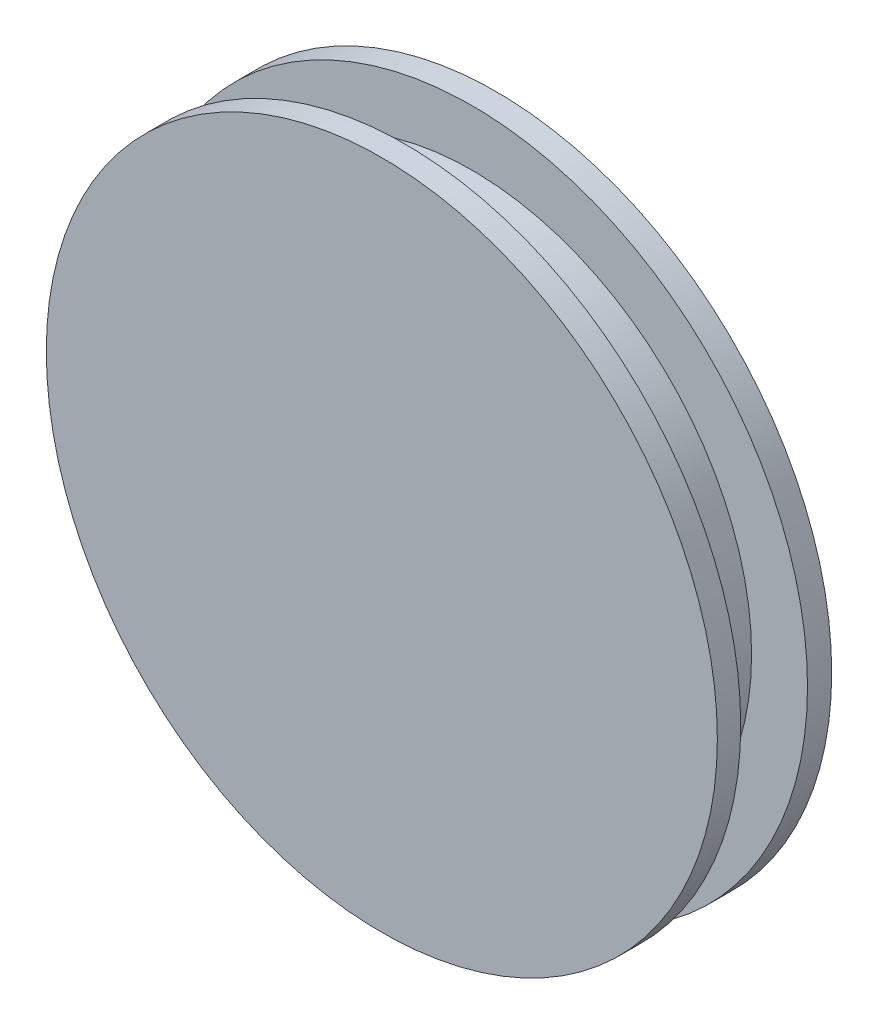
from build123d import *

# Parameters (mm, degrees)
SKETCH1_R          = 10.2108
EXTRUDE1_DEPTH     = 3.4798
SKETCH2_OUTSIDE_W  = 28.24
SKETCH2_OUTSIDE_H  = 28.24
SKETCH2_OUTSIDE_R  = 8.509
CUT_EXTRUDE1_DEPTH = 2.032


with BuildPart() as part:
    # Sketch1 → Extrude1 (new body)
    with BuildSketch(Plane.XY):
        Circle(SKETCH1_R)
    extrude(amount=EXTRUDE1_DEPTH)

    # Sketch2 outside → Cut-Extrude1 (cut)
    with BuildSketch(Plane.XY.offset(0.7366)):
        Rectangle(SKETCH2_OUTSIDE_W, SKETCH2_OUTSIDE_H)
        Circle(SKETCH2_OUTSIDE_R, mode=Mode.SUBTRACT)
    extrude(amount=CUT_EXTRUDE1_DEPTH, mode=Mode.SUBTRACT)


solid = part.part
